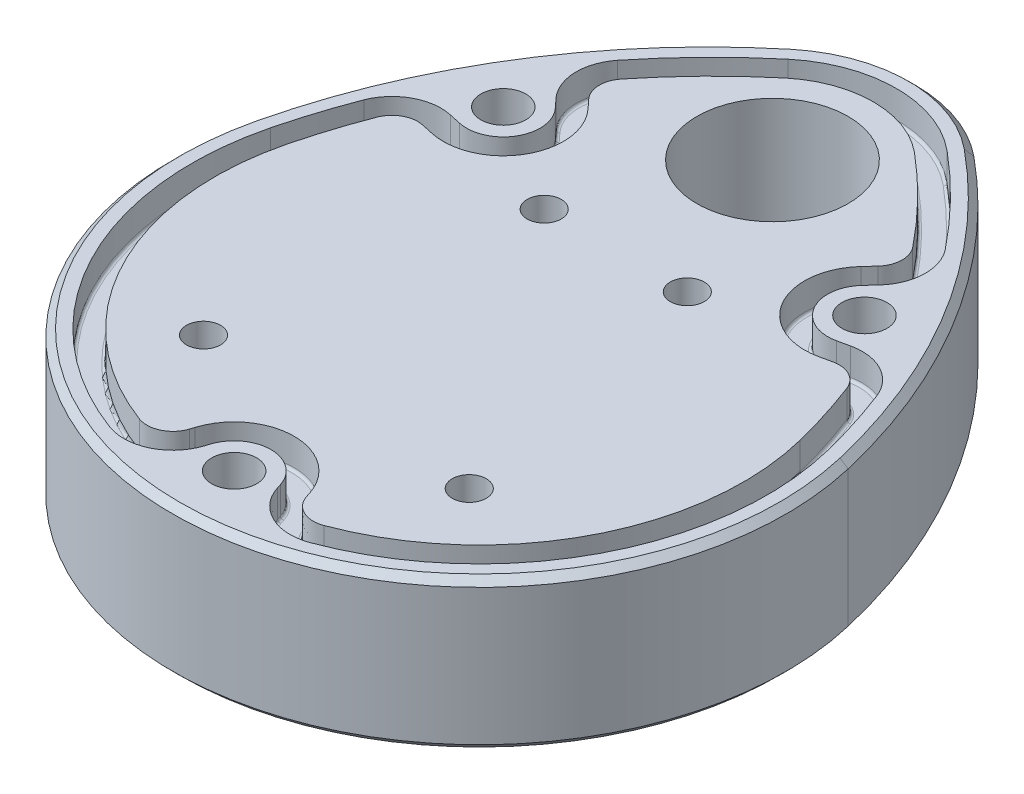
from build123d import *

# Parameters (mm, degrees)
EXTRUDE_1_DEPTH                   = 11
HOLE_WIZARD_M5_1_D                = 4.2
HOLE_WIZARD_M5_1_DEPTH            = 8
HOLE_WIZARD_M5_1_TIP              = 1.2618073
CHAMFER_1_SIZE                    = 0.5
SKETCH_23_R                       = 5.55
CUT_EXTRUDE_2_DEPTH               = 41.635575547
HOLE_WIZARD_M3_174741_D           = 3.3
HOLE_WIZARD_M3_174741_CSINK_D     = 7
HOLE_WIZARD_M3_174741_CSINK_ANGLE = 90
CUT_EXTRUDE_3_DEPTH               = 2.2
CHAMFER_3_SIZE                    = 0.5
HOLE_WIZARD_M3_1_D                = 2.5
HOLE_WIZARD_M3_1_DEPTH            = 7.5
HOLE_WIZARD_M3_1_TIP              = 0.751075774
SKETCH_39_R                       = 5.55
SKETCH_39_R_2                     = 3.25
EXTRUDE_2_DEPTH                   = 1
FILLET_1_R                        = 0.2


with BuildPart() as part:
    # Sketch 17 → Extrude 1 (new body)
    with BuildSketch(Plane(origin=(0, 0, 0), x_dir=(1, 0, 0), z_dir=(0, 1, 0))):
        with BuildLine():
            ThreePointArc((-6.665534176, 29.612992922), (0, 32), (6.665534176, 29.612992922))
            ThreePointArc((6.665534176, 29.612992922), (16.29358968, 18.637354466), (21.901040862, 5.156976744))
            ThreePointArc((21.901040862, 5.156976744), (22.331577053, -2.747847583), (19.997558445, -10.3125))
            ThreePointArc((19.997558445, -10.3125), (-7.793073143, -21.107297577), (-21.901040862, 5.156976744))
            ThreePointArc((-21.901040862, 5.156976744), (-16.29358968, 18.637354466), (-6.665534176, 29.612992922))
        make_face()
    extrude(amount=EXTRUDE_1_DEPTH)

    # Hole Wizard M5 _1
    with Locations(Plane(origin=(0, 0, 0), x_dir=(-1, 0, 0), z_dir=(0, -1, 0))):
        with Locations((0, 0)):
            Hole(HOLE_WIZARD_M5_1_D / 2, depth=HOLE_WIZARD_M5_1_DEPTH)
            with Locations((0, 0, -(HOLE_WIZARD_M5_1_DEPTH + HOLE_WIZARD_M5_1_TIP / 2))):  # 118° drill point
                Cone(0, HOLE_WIZARD_M5_1_D / 2, HOLE_WIZARD_M5_1_TIP, mode=Mode.SUBTRACT)

    # Chamfer 1
    chamfer_1_edges = [part.edges().sort_by_distance(p)[0] for p in [
        (16.29358968, 11, -18.637354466),
        (0, 11, -32),
        (-16.29358968, 11, -18.637354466),
        (0, 0, -32),
        (16.29358968, 0, -18.637354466),
        (0, 0, 22.5),
        (-16.29358968, 0, -18.637354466),
        (0, 11, 22.5),
    ]]
    chamfer(chamfer_1_edges, length=CHAMFER_1_SIZE)

    # Sketch 23 → Cut-Extrude 2 (cut, through all)
    with BuildSketch(Plane.XZ):
        with Locations(Location((0, -21.5, 0), (0, 0, 270))):
            Circle(SKETCH_23_R)
    extrude(amount=-CUT_EXTRUDE_2_DEPTH, mode=Mode.SUBTRACT)

    # Hole Wizard M3 _ _ _ _ _ _ 174741 (through all)
    with Locations(Plane(origin=(0, 0, 0), x_dir=(-1, 0, 0), z_dir=(0, -1, 0))):
        with Locations((13.25, 15), (-13.25, 15), (0, -18)):
            CounterSinkHole(HOLE_WIZARD_M3_174741_D / 2, HOLE_WIZARD_M3_174741_CSINK_D / 2, counter_sink_angle=HOLE_WIZARD_M3_174741_CSINK_ANGLE)

    # Sketch 34 → Cut-Extrude 3 (cut)
    with BuildSketch(Plane(origin=(0, 11, 0), x_dir=(1, 0, 0), z_dir=(0, 1, 0))):
        with BuildLine():
            ThreePointArc((-20.46585092, 5.131278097), (-18.670859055, -9.827517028), (-7.356027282, -19.775488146))
            add(Edge.make_bspline(
                [(-7.356027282, -19.775488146), (-6.902456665, -19.944205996), (-5.91347248, -20.09734087), (-4.47640619, -19.724358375), (-3.298210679, -18.817353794), (-2.813697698, -17.945033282), (-2.66844126, -17.484338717)],
                knots=[0, 0, 0, 0, 0.25, 0.5, 0.75, 1, 1, 1, 1], degree=3))
            Line((-2.66844126, -17.484338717), (-2.575035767, -17.188094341))
            ThreePointArc((-2.575035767, -17.188094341), (0, -15.3), (2.575035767, -17.188094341))
            Line((2.575035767, -17.188094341), (2.66844126, -17.484338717))
            add(Edge.make_bspline(
                [(2.66844126, -17.484338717), (2.813962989, -17.945874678), (3.300706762, -18.820300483), (4.477853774, -19.72506591), (5.917330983, -20.097500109), (6.903283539, -19.943898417), (7.356027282, -19.775488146)],
                knots=[0, 0, 0, 0, 0.25, 0.5, 0.75, 1, 1, 1, 1], degree=3))
            ThreePointArc((7.356027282, -19.775488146), (18.670859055, -9.827517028), (20.46585092, 5.131278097))
            ThreePointArc((20.46585092, 5.131278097), (19.721723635, 7.756071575), (18.818499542, 10.330455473))
            add(Edge.make_bspline(
                [(18.818499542, 10.330455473), (18.666169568, 10.725511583), (18.216328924, 11.467977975), (17.201113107, 12.272269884), (15.969840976, 12.676034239), (15.103176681, 12.642001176), (14.68981227, 12.551427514)],
                knots=[0, 0, 0, 0, 0.25, 0.5, 0.75, 1, 1, 1, 1], degree=3))
            Line((14.68981227, 12.551427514), (13.827896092, 12.36257017))
            ThreePointArc((13.827896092, 12.36257017), (10.908415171, 13.655760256), (11.263847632, 16.828988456))
            Line((11.263847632, 16.828988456), (11.857385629, 17.473528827))
            add(Edge.make_bspline(
                [(11.857385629, 17.473528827), (12.144394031, 17.785199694), (12.611282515, 18.517793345), (12.882835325, 19.785092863), (12.698998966, 21.068657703), (12.283945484, 21.830909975), (12.019271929, 22.16144835)],
                knots=[0, 0, 0, 0, 0.25, 0.5, 0.75, 1, 1, 1, 1], degree=3))
            ThreePointArc((12.019271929, 22.16144835), (9.08766382, 25.471883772), (5.842646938, 28.475743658))
            ThreePointArc((5.842646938, 28.475743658), (0, 30.599314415), (-5.842646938, 28.475743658))
            ThreePointArc((-5.842646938, 28.475743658), (-9.08766382, 25.471883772), (-12.019271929, 22.16144835))
            add(Edge.make_bspline(
                [(-12.019271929, 22.16144835), (-12.284096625, 21.830721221), (-12.699336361, 21.06766534), (-12.882820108, 19.784652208), (-12.610877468, 18.516826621), (-12.14423023, 17.785021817), (-11.857385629, 17.473528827)],
                knots=[0, 0, 0, 0, 0.25, 0.5, 0.75, 1, 1, 1, 1], degree=3))
            Line((-11.857385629, 17.473528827), (-11.263847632, 16.828988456))
            ThreePointArc((-11.263847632, 16.828988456), (-10.908415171, 13.655760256), (-13.827896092, 12.36257017))
            Line((-13.827896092, 12.36257017), (-14.68981227, 12.551427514))
            add(Edge.make_bspline(
                [(-14.68981227, 12.551427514), (-15.103407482, 12.642051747), (-15.970856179, 12.675899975), (-17.201492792, 12.272065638), (-18.217000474, 11.467204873), (-18.666254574, 10.725291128), (-18.818499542, 10.330455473)],
                knots=[0, 0, 0, 0, 0.25, 0.5, 0.75, 1, 1, 1, 1], degree=3))
            ThreePointArc((-18.818499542, 10.330455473), (-19.721723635, 7.756071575), (-20.46585092, 5.131278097))
        make_face()
        with BuildLine():
            ThreePointArc((6.763342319, -18.1821506), (17.166522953, -9.035700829), (18.816889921, 4.717844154))
            ThreePointArc((18.816889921, 4.717844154), (18.101126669, 7.242587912), (17.232330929, 9.71884356))
            add(Edge.make_bspline(
                [(17.232330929, 9.71884356), (17.151936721, 9.927339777), (16.91448993, 10.3192271), (16.378869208, 10.743523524), (15.729267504, 10.956581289), (15.271829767, 10.938624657), (15.053672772, 10.890823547)],
                knots=[0, 0, 0, 0, 0.25, 0.5, 0.75, 1, 1, 1, 1], degree=3))
            Line((15.053672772, 10.890823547), (14.191756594, 10.701966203))
            ThreePointArc((14.191756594, 10.701966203), (9.434083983, 12.809387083), (10.013307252, 17.98057378))
            Line((10.013307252, 17.98057378), (10.606845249, 18.625114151))
            add(Edge.make_bspline(
                [(10.606845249, 18.625114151), (10.758317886, 18.789602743), (11.004744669, 19.176290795), (11.147975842, 19.84488974), (11.051020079, 20.522096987), (10.831954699, 20.924427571), (10.692270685, 21.098872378)],
                knots=[0, 0, 0, 0, 0.25, 0.5, 0.75, 1, 1, 1, 1], degree=3))
            ThreePointArc((10.692270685, 21.098872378), (7.872407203, 24.283123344), (4.751081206, 27.172484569))
            ThreePointArc((4.751081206, 27.172484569), (0, 28.899314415), (-4.751081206, 27.172484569))
            ThreePointArc((-4.751081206, 27.172484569), (-7.872407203, 24.283123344), (-10.692270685, 21.098872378))
            add(Edge.make_bspline(
                [(-10.692270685, 21.098872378), (-10.832035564, 20.924326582), (-11.051200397, 20.521560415), (-11.14796838, 19.844673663), (-11.004527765, 19.17576794), (-10.758230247, 18.789507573), (-10.606845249, 18.625114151)],
                knots=[0, 0, 0, 0, 0.25, 0.5, 0.75, 1, 1, 1, 1], degree=3))
            Line((-10.606845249, 18.625114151), (-10.013307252, 17.98057378))
            ThreePointArc((-10.013307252, 17.98057378), (-9.434083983, 12.809387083), (-14.191756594, 10.701966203))
            Line((-14.191756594, 10.701966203), (-15.053672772, 10.890823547))
            add(Edge.make_bspline(
                [(-15.053672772, 10.890823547), (-15.271953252, 10.938651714), (-15.729815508, 10.956506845), (-16.379055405, 10.743423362), (-16.914854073, 10.318810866), (-17.151982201, 9.927221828), (-17.232330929, 9.71884356)],
                knots=[0, 0, 0, 0, 0.25, 0.5, 0.75, 1, 1, 1, 1], degree=3))
            ThreePointArc((-17.232330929, 9.71884356), (-18.101126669, 7.242587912), (-18.816889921, 4.717844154))
            ThreePointArc((-18.816889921, 4.717844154), (-17.166522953, -9.035700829), (-6.763342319, -18.1821506))
            add(Edge.make_bspline(
                [(-6.763342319, -18.1821506), (-6.523943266, -18.271201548), (-6.001843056, -18.352015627), (-5.243816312, -18.15520847), (-4.622195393, -17.676761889), (-4.366425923, -17.216291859), (-4.289760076, -16.973138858)],
                knots=[0, 0, 0, 0, 0.25, 0.5, 0.75, 1, 1, 1, 1], degree=3))
            Line((-4.289760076, -16.973138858), (-4.196354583, -16.676894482))
            ThreePointArc((-4.196354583, -16.676894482), (0, -13.6), (4.196354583, -16.676894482))
            Line((4.196354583, -16.676894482), (4.289760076, -16.973138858))
            add(Edge.make_bspline(
                [(4.289760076, -16.973138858), (4.366567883, -17.216742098), (4.623549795, -17.678347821), (5.244525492, -18.155555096), (6.003926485, -18.352110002), (6.524385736, -18.27103696), (6.763342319, -18.1821506)],
                knots=[0, 0, 0, 0, 0.25, 0.5, 0.75, 1, 1, 1, 1], degree=3))
        make_face(mode=Mode.SUBTRACT)
    extrude(amount=-CUT_EXTRUDE_3_DEPTH, mode=Mode.SUBTRACT)

    # Chamfer 3
    chamfer_3_edges = [part.edges().sort_by_distance(p)[0] for p in [
        (-2.1, 0, 0),
    ]]
    chamfer(chamfer_3_edges, length=CHAMFER_3_SIZE)

    # Hole Wizard M3 _1
    with Locations(Plane(origin=(0, 11, 0), x_dir=(1, 0, 0), z_dir=(0, 1, 0))):
        with Locations((5.25, 10), (9.75, -10.5), (-9.75, -10.5), (-5.25, 10)):
            Hole(HOLE_WIZARD_M3_1_D / 2, depth=HOLE_WIZARD_M3_1_DEPTH)
            with Locations((0, 0, -(HOLE_WIZARD_M3_1_DEPTH + HOLE_WIZARD_M3_1_TIP / 2))):  # 118° drill point
                Cone(0, HOLE_WIZARD_M3_1_D / 2, HOLE_WIZARD_M3_1_TIP, mode=Mode.SUBTRACT)

    # Sketch 39 → Extrude 2 (add)
    with BuildSketch(Plane.XZ):
        with Locations(Location((0, -21.5, 0), (0, 0, 270))):
            Circle(SKETCH_39_R)
        with Locations(Location((0, -21.5, 0), (0, 0, 270))):
            Circle(SKETCH_39_R_2, mode=Mode.SUBTRACT)
    extrude(amount=-EXTRUDE_2_DEPTH)

    # Fillet 1
    fillet_1_edges = [part.edges().sort_by_distance(p)[0] for p in [
        (-9.08766382, 8.8, -25.471883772),
        (0, 8.8, -30.599314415),
        (9.08766382, 8.8, -25.471883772),
        (11.107939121, 8.8, -19.846162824),
        (16.360011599, 8.8, -10.708242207),
        (19.721723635, 8.8, -7.756071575),
        (18.670859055, 8.8, 9.827517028),
        (5.267067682, 8.8, 18.108521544),
        (-5.267079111, 8.8, 18.10852713),
        (-18.670859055, 8.8, 9.827517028),
        (-19.721723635, 8.8, -7.756071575),
        (14.622714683, 8.8, -10.796394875),
        (9.434083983, 8.8, -12.809387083),
        (10.31007625, 8.8, -18.302843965),
        (-10.31007625, 8.8, -18.302843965),
        (-9.434083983, 8.8, -12.809387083),
        (-14.622714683, 8.8, -10.796394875),
        (-4.24305733, 8.8, 16.82501667),
        (0, 8.8, 13.6),
        (4.24305733, 8.8, 16.82501667),
        (-16.360009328, 8.8, -10.708243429),
        (5.267067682, 8.8, 18.108521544),
        (17.166522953, 8.8, 9.035700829),
        (18.101126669, 8.8, -7.242587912),
        (16.360011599, 8.8, -10.708242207),
        (11.107939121, 8.8, -19.846162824),
        (7.872407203, 8.8, -24.283123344),
        (0, 8.8, -28.899314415),
        (-7.872407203, 8.8, -24.283123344),
        (-11.107939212, 8.8, -19.846165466),
        (-16.360009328, 8.8, -10.708243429),
        (-18.101126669, 8.8, -7.242587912),
        (-17.166522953, 8.8, 9.035700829),
        (-5.267079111, 8.8, 18.10852713),
        (-14.258854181, 8.8, -12.456998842),
        (-10.908415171, 8.8, -13.655760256),
        (-11.56061663, 8.8, -17.151258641),
        (11.56061663, 8.8, -17.151258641),
        (10.908415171, 8.8, -13.655760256),
        (14.258854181, 8.8, -12.456998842),
        (2.621738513, 8.8, 17.336216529),
        (0, 8.8, 15.3),
        (-2.621738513, 8.8, 17.336216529),
        (0, 1, -15.95),
        (-11.107939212, 8.8, -19.846165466),
    ]]
    fillet(fillet_1_edges, radius=FILLET_1_R)


solid = part.part
